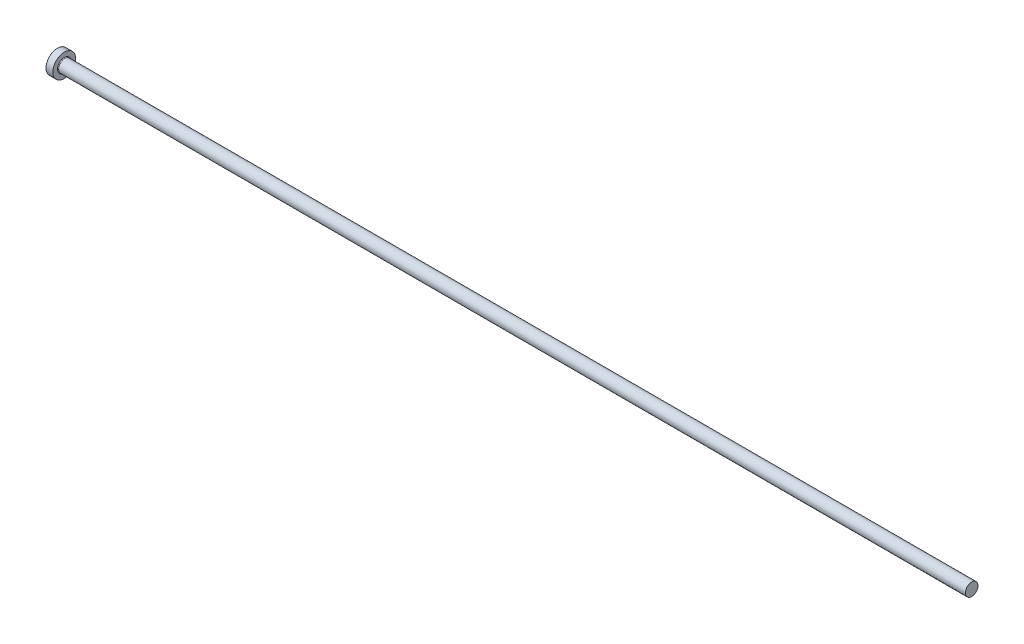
ISO-10303-21;
HEADER;
FILE_DESCRIPTION(('STEP AP214'),'2;1');
FILE_NAME('part.step','',(''),(''),'','','');
FILE_SCHEMA(('AUTOMOTIVE_DESIGN { 1 0 10303 214 1 1 1 1 }'));
ENDSEC;
DATA;
#1=APPLICATION_CONTEXT('core data for automotive mechanical design processes');
#2=APPLICATION_PROTOCOL_DEFINITION('international standard','automotive_design',2000,#1);
#3=PRODUCT_CONTEXT('',#1,'mechanical');
#4=PRODUCT('Part','Part','',(#3));
#5=PRODUCT_RELATED_PRODUCT_CATEGORY('part','',(#4));
#6=PRODUCT_DEFINITION_FORMATION('','',#4);
#7=PRODUCT_DEFINITION_CONTEXT('part definition',#1,'design');
#8=PRODUCT_DEFINITION('design','',#6,#7);
#9=PRODUCT_DEFINITION_SHAPE('','',#8);
#10=(LENGTH_UNIT() NAMED_UNIT(*) SI_UNIT(.MILLI.,.METRE.));
#11=(NAMED_UNIT(*) PLANE_ANGLE_UNIT() SI_UNIT($,.RADIAN.));
#12=(NAMED_UNIT(*) SI_UNIT($,.STERADIAN.) SOLID_ANGLE_UNIT());
#13=UNCERTAINTY_MEASURE_WITH_UNIT(LENGTH_MEASURE(1.E-05),#10,'distance_accuracy_value','');
#14=(GEOMETRIC_REPRESENTATION_CONTEXT(3) GLOBAL_UNCERTAINTY_ASSIGNED_CONTEXT((#13)) GLOBAL_UNIT_ASSIGNED_CONTEXT((#10,
#11,#12)) REPRESENTATION_CONTEXT('',''));
#15=CARTESIAN_POINT('',(0.,0.,0.));
#16=DIRECTION('',(0.,0.,1.));
#17=DIRECTION('',(1.,0.,0.));
#18=AXIS2_PLACEMENT_3D('',#15,#16,#17);
#19=CARTESIAN_POINT('',(0.,0.,0.));
#20=DIRECTION('',(-1.,0.,0.));
#21=DIRECTION('',(0.,-1.,0.));
#22=AXIS2_PLACEMENT_3D('',#19,#20,#21);
#23=PLANE('',#22);
#24=CARTESIAN_POINT('',(0.,0.,0.));
#25=DIRECTION('',(1.,0.,0.));
#26=DIRECTION('',(0.,1.,0.));
#27=AXIS2_PLACEMENT_3D('',#24,#25,#26);
#28=CIRCLE('',#27,5.);
#29=CARTESIAN_POINT('',(0.,5.,0.));
#30=VERTEX_POINT('',#29);
#31=EDGE_CURVE('E25',#30,#30,#28,.T.);
#32=ORIENTED_EDGE('',*,*,#31,.F.);
#33=EDGE_LOOP('',(#32));
#34=FACE_BOUND('',#33,.T.);
#35=ADVANCED_FACE('F14',(#34),#23,.T.);
#36=CARTESIAN_POINT('',(400.,0.,0.));
#37=DIRECTION('',(1.,0.,0.));
#38=DIRECTION('',(0.,1.,0.));
#39=AXIS2_PLACEMENT_3D('',#36,#37,#38);
#40=CYLINDRICAL_SURFACE('',#39,5.);
#41=ORIENTED_EDGE('',*,*,#31,.T.);
#42=EDGE_LOOP('',(#41));
#43=FACE_BOUND('',#42,.T.);
#44=CARTESIAN_POINT('',(3.,0.,0.));
#45=DIRECTION('',(1.,0.,0.));
#46=DIRECTION('',(0.,1.,0.));
#47=AXIS2_PLACEMENT_3D('',#44,#45,#46);
#48=CIRCLE('',#47,5.);
#49=CARTESIAN_POINT('',(3.,5.,0.));
#50=VERTEX_POINT('',#49);
#51=EDGE_CURVE('E29',#50,#50,#48,.T.);
#52=ORIENTED_EDGE('',*,*,#51,.F.);
#53=EDGE_LOOP('',(#52));
#54=FACE_BOUND('',#53,.T.);
#55=ADVANCED_FACE('F51',(#43,#54),#40,.T.);
#56=CARTESIAN_POINT('',(3.,5.,0.));
#57=DIRECTION('',(1.,0.,0.));
#58=DIRECTION('',(0.,1.,0.));
#59=AXIS2_PLACEMENT_3D('',#56,#57,#58);
#60=PLANE('',#59);
#61=CARTESIAN_POINT('',(3.,0.,0.));
#62=DIRECTION('',(1.,0.,0.));
#63=DIRECTION('',(0.,1.,0.));
#64=AXIS2_PLACEMENT_3D('',#61,#62,#63);
#65=CIRCLE('',#64,3.04999999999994);
#66=CARTESIAN_POINT('',(3.,3.04999999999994,0.));
#67=VERTEX_POINT('',#66);
#68=EDGE_CURVE('E9',#67,#67,#65,.F.);
#69=ORIENTED_EDGE('',*,*,#68,.T.);
#70=EDGE_LOOP('',(#69));
#71=FACE_BOUND('',#70,.T.);
#72=ORIENTED_EDGE('',*,*,#51,.T.);
#73=EDGE_LOOP('',(#72));
#74=FACE_BOUND('',#73,.T.);
#75=ADVANCED_FACE('F42',(#71,#74),#60,.T.);
#76=CARTESIAN_POINT('',(400.,0.,0.));
#77=DIRECTION('',(1.,0.,0.));
#78=DIRECTION('',(0.,1.,0.));
#79=AXIS2_PLACEMENT_3D('',#76,#77,#78);
#80=CYLINDRICAL_SURFACE('',#79,2.74999999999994);
#81=CARTESIAN_POINT('',(3.3,0.,0.));
#82=DIRECTION('',(1.,0.,0.));
#83=DIRECTION('',(0.,1.,0.));
#84=AXIS2_PLACEMENT_3D('',#81,#82,#83);
#85=CIRCLE('',#84,2.74999999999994);
#86=CARTESIAN_POINT('',(3.3,2.74999999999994,0.));
#87=VERTEX_POINT('',#86);
#88=EDGE_CURVE('E21',#87,#87,#85,.T.);
#89=ORIENTED_EDGE('',*,*,#88,.T.);
#90=EDGE_LOOP('',(#89));
#91=FACE_BOUND('',#90,.T.);
#92=CARTESIAN_POINT('',(400.,0.,0.));
#93=DIRECTION('',(1.,0.,0.));
#94=DIRECTION('',(0.,1.,0.));
#95=AXIS2_PLACEMENT_3D('',#92,#93,#94);
#96=CIRCLE('',#95,2.74999999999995);
#97=CARTESIAN_POINT('',(400.,2.74999999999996,0.));
#98=VERTEX_POINT('',#97);
#99=EDGE_CURVE('E34',#98,#98,#96,.T.);
#100=ORIENTED_EDGE('',*,*,#99,.F.);
#101=EDGE_LOOP('',(#100));
#102=FACE_BOUND('',#101,.T.);
#103=ADVANCED_FACE('F40',(#91,#102),#80,.T.);
#104=CARTESIAN_POINT('',(400.,2.74999999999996,0.));
#105=DIRECTION('',(1.,0.,0.));
#106=DIRECTION('',(0.,1.,0.));
#107=AXIS2_PLACEMENT_3D('',#104,#105,#106);
#108=PLANE('',#107);
#109=ORIENTED_EDGE('',*,*,#99,.T.);
#110=EDGE_LOOP('',(#109));
#111=FACE_BOUND('',#110,.T.);
#112=ADVANCED_FACE('F38',(#111),#108,.T.);
#113=CARTESIAN_POINT('',(3.3,0.,0.));
#114=DIRECTION('',(1.,0.,0.));
#115=DIRECTION('',(0.,1.,0.));
#116=AXIS2_PLACEMENT_3D('',#113,#114,#115);
#117=TOROIDAL_SURFACE('',#116,3.04999999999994,0.3);
#118=ORIENTED_EDGE('',*,*,#68,.F.);
#119=EDGE_LOOP('',(#118));
#120=FACE_BOUND('',#119,.T.);
#121=ORIENTED_EDGE('',*,*,#88,.F.);
#122=EDGE_LOOP('',(#121));
#123=FACE_BOUND('',#122,.T.);
#124=ADVANCED_FACE('F16',(#120,#123),#117,.F.);
#125=CLOSED_SHELL('',(#35,#55,#75,#103,#112,#124));
#126=MANIFOLD_SOLID_BREP('B1',#125);
#127=ADVANCED_BREP_SHAPE_REPRESENTATION('',(#18,#126),#14);
#128=SHAPE_DEFINITION_REPRESENTATION(#9,#127);
ENDSEC;
END-ISO-10303-21;
